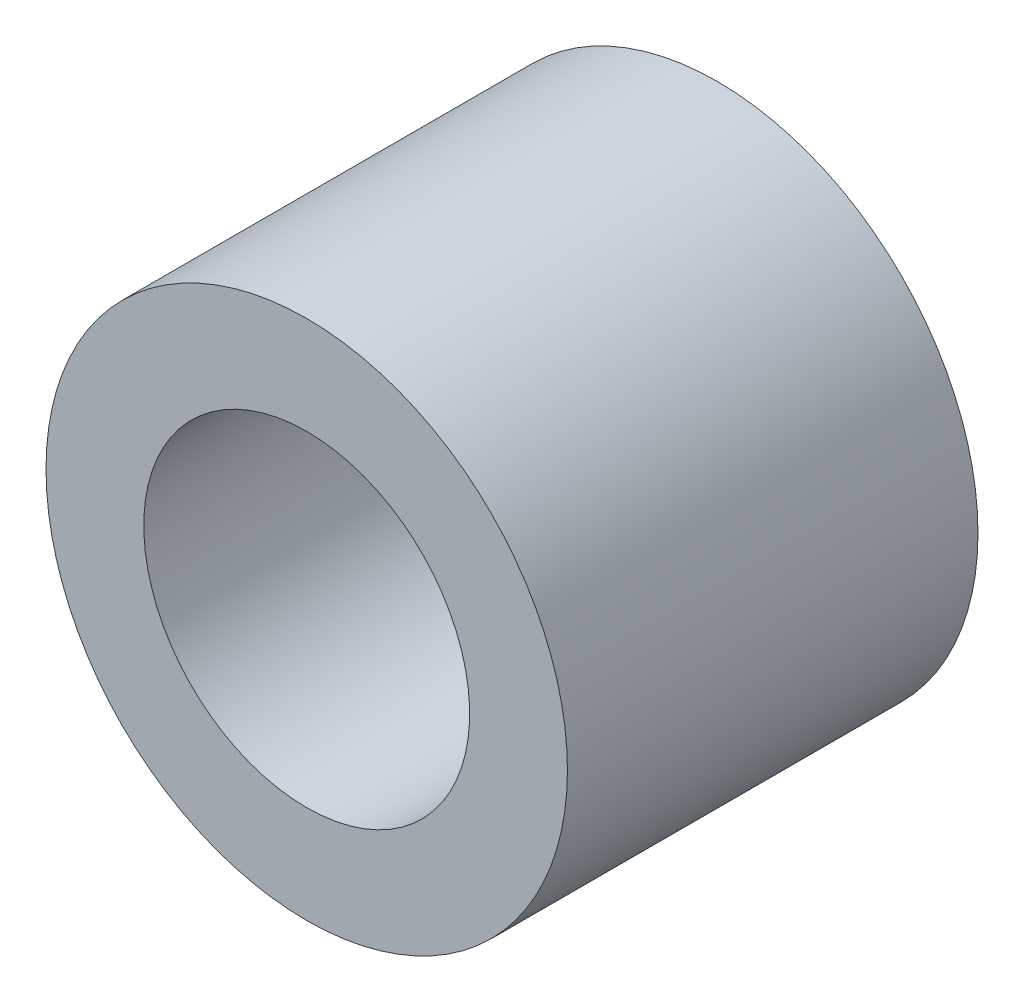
ISO-10303-21;
HEADER;
FILE_DESCRIPTION(('STEP AP214'),'2;1');
FILE_NAME('part.step','',(''),(''),'','','');
FILE_SCHEMA(('AUTOMOTIVE_DESIGN { 1 0 10303 214 1 1 1 1 }'));
ENDSEC;
DATA;
#1=APPLICATION_CONTEXT('core data for automotive mechanical design processes');
#2=APPLICATION_PROTOCOL_DEFINITION('international standard','automotive_design',2000,#1);
#3=PRODUCT_CONTEXT('',#1,'mechanical');
#4=PRODUCT('Part','Part','',(#3));
#5=PRODUCT_RELATED_PRODUCT_CATEGORY('part','',(#4));
#6=PRODUCT_DEFINITION_FORMATION('','',#4);
#7=PRODUCT_DEFINITION_CONTEXT('part definition',#1,'design');
#8=PRODUCT_DEFINITION('design','',#6,#7);
#9=PRODUCT_DEFINITION_SHAPE('','',#8);
#10=(LENGTH_UNIT() NAMED_UNIT(*) SI_UNIT(.MILLI.,.METRE.));
#11=(NAMED_UNIT(*) PLANE_ANGLE_UNIT() SI_UNIT($,.RADIAN.));
#12=(NAMED_UNIT(*) SI_UNIT($,.STERADIAN.) SOLID_ANGLE_UNIT());
#13=UNCERTAINTY_MEASURE_WITH_UNIT(LENGTH_MEASURE(1.E-05),#10,'distance_accuracy_value','');
#14=(GEOMETRIC_REPRESENTATION_CONTEXT(3) GLOBAL_UNCERTAINTY_ASSIGNED_CONTEXT((#13)) GLOBAL_UNIT_ASSIGNED_CONTEXT((#10,
#11,#12)) REPRESENTATION_CONTEXT('',''));
#15=CARTESIAN_POINT('',(0.,0.,0.));
#16=DIRECTION('',(0.,0.,1.));
#17=DIRECTION('',(1.,0.,0.));
#18=AXIS2_PLACEMENT_3D('',#15,#16,#17);
#19=CARTESIAN_POINT('',(0.,-1.3964063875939E-13,112.221454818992));
#20=DIRECTION('',(0.,0.,1.));
#21=DIRECTION('',(0.,-1.,0.));
#22=AXIS2_PLACEMENT_3D('',#19,#20,#21);
#23=CYLINDRICAL_SURFACE('',#22,1.58749999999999);
#24=CARTESIAN_POINT('',(0.,-1.3964063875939E-13,112.221454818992));
#25=DIRECTION('',(0.,0.,-1.));
#26=DIRECTION('',(0.,1.,0.));
#27=AXIS2_PLACEMENT_3D('',#24,#25,#26);
#28=CIRCLE('',#27,1.58749999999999);
#29=CARTESIAN_POINT('',(0.,1.58749999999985,112.221454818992));
#30=VERTEX_POINT('',#29);
#31=EDGE_CURVE('E62',#30,#30,#28,.T.);
#32=ORIENTED_EDGE('',*,*,#31,.T.);
#33=EDGE_LOOP('',(#32));
#34=FACE_BOUND('',#33,.T.);
#35=CARTESIAN_POINT('',(0.,-1.44747664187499E-13,116.221454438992));
#36=DIRECTION('',(0.,0.,-1.));
#37=DIRECTION('',(0.,1.,0.));
#38=AXIS2_PLACEMENT_3D('',#35,#36,#37);
#39=CIRCLE('',#38,1.58749999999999);
#40=CARTESIAN_POINT('',(0.,1.58749999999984,116.221454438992));
#41=VERTEX_POINT('',#40);
#42=EDGE_CURVE('E68',#41,#41,#39,.T.);
#43=ORIENTED_EDGE('',*,*,#42,.F.);
#44=EDGE_LOOP('',(#43));
#45=FACE_BOUND('',#44,.T.);
#46=ADVANCED_FACE('F55',(#34,#45),#23,.F.);
#47=CARTESIAN_POINT('',(0.,-1.47509690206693E-13,116.221454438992));
#48=DIRECTION('',(0.,0.,-1.));
#49=DIRECTION('',(0.,1.,0.));
#50=AXIS2_PLACEMENT_3D('',#47,#48,#49);
#51=PLANE('',#50);
#52=ORIENTED_EDGE('',*,*,#42,.T.);
#53=EDGE_LOOP('',(#52));
#54=FACE_BOUND('',#53,.T.);
#55=CARTESIAN_POINT('',(0.,-1.44747664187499E-13,116.221454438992));
#56=DIRECTION('',(0.,0.,-1.));
#57=DIRECTION('',(0.,1.,0.));
#58=AXIS2_PLACEMENT_3D('',#55,#56,#57);
#59=CIRCLE('',#58,2.54000000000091);
#60=CARTESIAN_POINT('',(0.,2.54000000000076,116.221454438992));
#61=VERTEX_POINT('',#60);
#62=EDGE_CURVE('E58',#61,#61,#59,.T.);
#63=ORIENTED_EDGE('',*,*,#62,.F.);
#64=EDGE_LOOP('',(#63));
#65=FACE_BOUND('',#64,.T.);
#66=ADVANCED_FACE('F77',(#54,#65),#51,.F.);
#67=CARTESIAN_POINT('',(0.,-1.3964063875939E-13,112.221454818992));
#68=DIRECTION('',(0.,0.,1.));
#69=DIRECTION('',(0.,-1.,0.));
#70=AXIS2_PLACEMENT_3D('',#67,#68,#69);
#71=CYLINDRICAL_SURFACE('',#70,2.54000000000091);
#72=CARTESIAN_POINT('',(0.,-1.3964063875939E-13,112.221454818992));
#73=DIRECTION('',(0.,0.,-1.));
#74=DIRECTION('',(0.,1.,0.));
#75=AXIS2_PLACEMENT_3D('',#72,#73,#74);
#76=CIRCLE('',#75,2.54000000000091);
#77=CARTESIAN_POINT('',(0.,2.54000000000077,112.221454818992));
#78=VERTEX_POINT('',#77);
#79=EDGE_CURVE('E11',#78,#78,#76,.T.);
#80=ORIENTED_EDGE('',*,*,#79,.F.);
#81=EDGE_LOOP('',(#80));
#82=FACE_BOUND('',#81,.T.);
#83=ORIENTED_EDGE('',*,*,#62,.T.);
#84=EDGE_LOOP('',(#83));
#85=FACE_BOUND('',#84,.T.);
#86=ADVANCED_FACE('F75',(#82,#85),#71,.T.);
#87=CARTESIAN_POINT('',(0.,-1.42402664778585E-13,112.221454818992));
#88=DIRECTION('',(0.,0.,-1.));
#89=DIRECTION('',(0.,1.,0.));
#90=AXIS2_PLACEMENT_3D('',#87,#88,#89);
#91=PLANE('',#90);
#92=ORIENTED_EDGE('',*,*,#31,.F.);
#93=EDGE_LOOP('',(#92));
#94=FACE_BOUND('',#93,.T.);
#95=ORIENTED_EDGE('',*,*,#79,.T.);
#96=EDGE_LOOP('',(#95));
#97=FACE_BOUND('',#96,.T.);
#98=ADVANCED_FACE('F84',(#94,#97),#91,.T.);
#99=CLOSED_SHELL('',(#46,#66,#86,#98));
#100=MANIFOLD_SOLID_BREP('B2',#99);
#101=ADVANCED_BREP_SHAPE_REPRESENTATION('',(#18,#100),#14);
#102=SHAPE_DEFINITION_REPRESENTATION(#9,#101);
ENDSEC;
END-ISO-10303-21;
